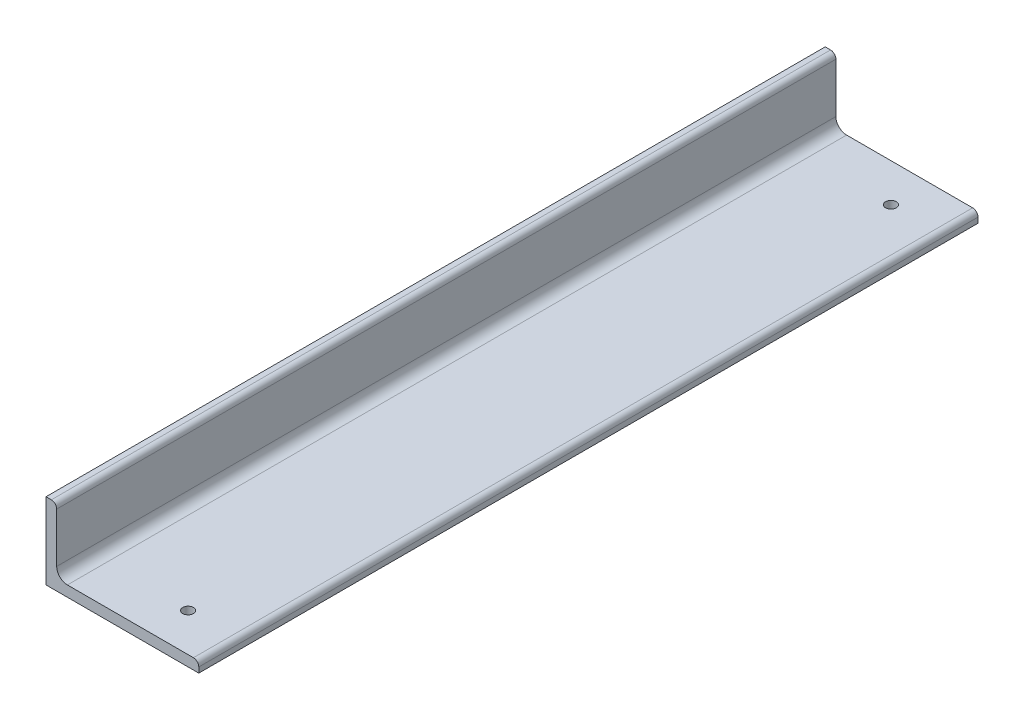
ISO-10303-21;
HEADER;
FILE_DESCRIPTION(('STEP AP214'),'2;1');
FILE_NAME('part.step','',(''),(''),'','','');
FILE_SCHEMA(('AUTOMOTIVE_DESIGN { 1 0 10303 214 1 1 1 1 }'));
ENDSEC;
DATA;
#1=APPLICATION_CONTEXT('core data for automotive mechanical design processes');
#2=APPLICATION_PROTOCOL_DEFINITION('international standard','automotive_design',2000,#1);
#3=PRODUCT_CONTEXT('',#1,'mechanical');
#4=PRODUCT('Part','Part','',(#3));
#5=PRODUCT_RELATED_PRODUCT_CATEGORY('part','',(#4));
#6=PRODUCT_DEFINITION_FORMATION('','',#4);
#7=PRODUCT_DEFINITION_CONTEXT('part definition',#1,'design');
#8=PRODUCT_DEFINITION('design','',#6,#7);
#9=PRODUCT_DEFINITION_SHAPE('','',#8);
#10=(LENGTH_UNIT() NAMED_UNIT(*) SI_UNIT(.MILLI.,.METRE.));
#11=(NAMED_UNIT(*) PLANE_ANGLE_UNIT() SI_UNIT($,.RADIAN.));
#12=(NAMED_UNIT(*) SI_UNIT($,.STERADIAN.) SOLID_ANGLE_UNIT());
#13=UNCERTAINTY_MEASURE_WITH_UNIT(LENGTH_MEASURE(1.E-05),#10,'distance_accuracy_value','');
#14=(GEOMETRIC_REPRESENTATION_CONTEXT(3) GLOBAL_UNCERTAINTY_ASSIGNED_CONTEXT((#13)) GLOBAL_UNIT_ASSIGNED_CONTEXT((#10,
#11,#12)) REPRESENTATION_CONTEXT('',''));
#15=CARTESIAN_POINT('',(0.,0.,0.));
#16=DIRECTION('',(0.,0.,1.));
#17=DIRECTION('',(1.,0.,0.));
#18=AXIS2_PLACEMENT_3D('',#15,#16,#17);
#19=CARTESIAN_POINT('',(0.,0.,1020.));
#20=DIRECTION('',(0.,1.,0.));
#21=DIRECTION('',(0.,0.,1.));
#22=AXIS2_PLACEMENT_3D('',#19,#20,#21);
#23=PLANE('',#22);
#24=CARTESIAN_POINT('',(136.,0.,970.));
#25=DIRECTION('',(0.,-1.,0.));
#26=DIRECTION('',(0.,0.,-1.));
#27=AXIS2_PLACEMENT_3D('',#24,#25,#26);
#28=CIRCLE('',#27,7.00000000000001);
#29=CARTESIAN_POINT('',(136.,0.,963.));
#30=VERTEX_POINT('',#29);
#31=EDGE_CURVE('E217',#30,#30,#28,.T.);
#32=ORIENTED_EDGE('',*,*,#31,.F.);
#33=EDGE_LOOP('',(#32));
#34=FACE_BOUND('',#33,.T.);
#35=CARTESIAN_POINT('',(136.,0.,50.));
#36=DIRECTION('',(0.,-1.,0.));
#37=DIRECTION('',(0.,0.,-1.));
#38=AXIS2_PLACEMENT_3D('',#35,#36,#37);
#39=CIRCLE('',#38,7.00000000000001);
#40=CARTESIAN_POINT('',(136.,0.,43.));
#41=VERTEX_POINT('',#40);
#42=EDGE_CURVE('E122',#41,#41,#39,.T.);
#43=ORIENTED_EDGE('',*,*,#42,.F.);
#44=EDGE_LOOP('',(#43));
#45=FACE_BOUND('',#44,.T.);
#46=DIRECTION('',(1.,0.,0.));
#47=VECTOR('',#46,1.);
#48=CARTESIAN_POINT('',(0.,0.,0.));
#49=LINE('',#48,#47);
#50=CARTESIAN_POINT('',(0.,0.,0.));
#51=VERTEX_POINT('',#50);
#52=CARTESIAN_POINT('',(200.,0.,0.));
#53=VERTEX_POINT('',#52);
#54=EDGE_CURVE('E105',#51,#53,#49,.T.);
#55=ORIENTED_EDGE('',*,*,#54,.T.);
#56=DIRECTION('',(0.,0.,-1.));
#57=VECTOR('',#56,1.);
#58=CARTESIAN_POINT('',(200.,0.,1020.));
#59=LINE('',#58,#57);
#60=CARTESIAN_POINT('',(200.,0.,1020.));
#61=VERTEX_POINT('',#60);
#62=EDGE_CURVE('E11',#61,#53,#59,.T.);
#63=ORIENTED_EDGE('',*,*,#62,.F.);
#64=DIRECTION('',(1.,0.,0.));
#65=VECTOR('',#64,1.);
#66=CARTESIAN_POINT('',(0.,0.,1020.));
#67=LINE('',#66,#65);
#68=CARTESIAN_POINT('',(0.,0.,1020.));
#69=VERTEX_POINT('',#68);
#70=EDGE_CURVE('E139',#69,#61,#67,.T.);
#71=ORIENTED_EDGE('',*,*,#70,.F.);
#72=DIRECTION('',(0.,0.,-1.));
#73=VECTOR('',#72,1.);
#74=CARTESIAN_POINT('',(0.,0.,1020.));
#75=LINE('',#74,#73);
#76=EDGE_CURVE('E118',#69,#51,#75,.T.);
#77=ORIENTED_EDGE('',*,*,#76,.T.);
#78=EDGE_LOOP('',(#55,#63,#71,#77));
#79=FACE_BOUND('',#78,.T.);
#80=ADVANCED_FACE('F31',(#34,#45,#79),#23,.F.);
#81=CARTESIAN_POINT('',(200.,6.99999999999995,1020.));
#82=DIRECTION('',(-1.,0.,0.));
#83=DIRECTION('',(0.,0.,1.));
#84=AXIS2_PLACEMENT_3D('',#81,#82,#83);
#85=PLANE('',#84);
#86=DIRECTION('',(0.,1.,0.));
#87=VECTOR('',#86,1.);
#88=CARTESIAN_POINT('',(200.,6.99999999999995,0.));
#89=LINE('',#88,#87);
#90=CARTESIAN_POINT('',(200.,6.99999999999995,0.));
#91=VERTEX_POINT('',#90);
#92=EDGE_CURVE('E101',#53,#91,#89,.T.);
#93=ORIENTED_EDGE('',*,*,#92,.T.);
#94=DIRECTION('',(0.,0.,-1.));
#95=VECTOR('',#94,1.);
#96=CARTESIAN_POINT('',(200.,6.99999999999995,1020.));
#97=LINE('',#96,#95);
#98=CARTESIAN_POINT('',(200.,6.99999999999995,1020.));
#99=VERTEX_POINT('',#98);
#100=EDGE_CURVE('E38',#99,#91,#97,.T.);
#101=ORIENTED_EDGE('',*,*,#100,.F.);
#102=DIRECTION('',(0.,1.,0.));
#103=VECTOR('',#102,1.);
#104=CARTESIAN_POINT('',(200.,6.99999999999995,1020.));
#105=LINE('',#104,#103);
#106=EDGE_CURVE('E114',#61,#99,#105,.T.);
#107=ORIENTED_EDGE('',*,*,#106,.F.);
#108=ORIENTED_EDGE('',*,*,#62,.T.);
#109=EDGE_LOOP('',(#93,#101,#107,#108));
#110=FACE_BOUND('',#109,.T.);
#111=ADVANCED_FACE('F113',(#110),#85,.F.);
#112=CARTESIAN_POINT('',(193.,7.,1020.));
#113=DIRECTION('',(0.,0.,-1.));
#114=DIRECTION('',(-1.,0.,0.));
#115=AXIS2_PLACEMENT_3D('',#112,#113,#114);
#116=CYLINDRICAL_SURFACE('',#115,7.);
#117=CARTESIAN_POINT('',(193.,7.,0.));
#118=DIRECTION('',(0.,0.,1.));
#119=DIRECTION('',(1.,0.,0.));
#120=AXIS2_PLACEMENT_3D('',#117,#118,#119);
#121=CIRCLE('',#120,7.);
#122=CARTESIAN_POINT('',(193.,14.,0.));
#123=VERTEX_POINT('',#122);
#124=EDGE_CURVE('E107',#91,#123,#121,.T.);
#125=ORIENTED_EDGE('',*,*,#124,.T.);
#126=DIRECTION('',(0.,0.,-1.));
#127=VECTOR('',#126,1.);
#128=CARTESIAN_POINT('',(193.,14.,1020.));
#129=LINE('',#128,#127);
#130=CARTESIAN_POINT('',(193.,14.,1020.));
#131=VERTEX_POINT('',#130);
#132=EDGE_CURVE('E170',#131,#123,#129,.T.);
#133=ORIENTED_EDGE('',*,*,#132,.F.);
#134=CARTESIAN_POINT('',(193.,7.,1020.));
#135=DIRECTION('',(0.,0.,1.));
#136=DIRECTION('',(1.,0.,0.));
#137=AXIS2_PLACEMENT_3D('',#134,#135,#136);
#138=CIRCLE('',#137,7.);
#139=EDGE_CURVE('E142',#99,#131,#138,.T.);
#140=ORIENTED_EDGE('',*,*,#139,.F.);
#141=ORIENTED_EDGE('',*,*,#100,.T.);
#142=EDGE_LOOP('',(#125,#133,#140,#141));
#143=FACE_BOUND('',#142,.T.);
#144=ADVANCED_FACE('F174',(#143),#116,.T.);
#145=CARTESIAN_POINT('',(28.,14.,1020.));
#146=DIRECTION('',(0.,-1.,0.));
#147=DIRECTION('',(1.,0.,0.));
#148=AXIS2_PLACEMENT_3D('',#145,#146,#147);
#149=PLANE('',#148);
#150=CARTESIAN_POINT('',(136.,14.,970.));
#151=DIRECTION('',(0.,-1.,0.));
#152=DIRECTION('',(1.,0.,0.));
#153=AXIS2_PLACEMENT_3D('',#150,#151,#152);
#154=CIRCLE('',#153,7.00000000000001);
#155=CARTESIAN_POINT('',(143.,14.,970.));
#156=VERTEX_POINT('',#155);
#157=EDGE_CURVE('E221',#156,#156,#154,.T.);
#158=ORIENTED_EDGE('',*,*,#157,.T.);
#159=EDGE_LOOP('',(#158));
#160=FACE_BOUND('',#159,.T.);
#161=CARTESIAN_POINT('',(136.,14.,50.));
#162=DIRECTION('',(0.,-1.,0.));
#163=DIRECTION('',(1.,0.,0.));
#164=AXIS2_PLACEMENT_3D('',#161,#162,#163);
#165=CIRCLE('',#164,7.00000000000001);
#166=CARTESIAN_POINT('',(143.,14.,50.));
#167=VERTEX_POINT('',#166);
#168=EDGE_CURVE('E119',#167,#167,#165,.T.);
#169=ORIENTED_EDGE('',*,*,#168,.T.);
#170=EDGE_LOOP('',(#169));
#171=FACE_BOUND('',#170,.T.);
#172=DIRECTION('',(-1.,0.,0.));
#173=VECTOR('',#172,1.);
#174=CARTESIAN_POINT('',(28.,14.,0.));
#175=LINE('',#174,#173);
#176=CARTESIAN_POINT('',(28.,14.,0.));
#177=VERTEX_POINT('',#176);
#178=EDGE_CURVE('E127',#123,#177,#175,.T.);
#179=ORIENTED_EDGE('',*,*,#178,.T.);
#180=DIRECTION('',(0.,0.,-1.));
#181=VECTOR('',#180,1.);
#182=CARTESIAN_POINT('',(28.,14.,1020.));
#183=LINE('',#182,#181);
#184=CARTESIAN_POINT('',(28.,14.,1020.));
#185=VERTEX_POINT('',#184);
#186=EDGE_CURVE('E167',#185,#177,#183,.T.);
#187=ORIENTED_EDGE('',*,*,#186,.F.);
#188=DIRECTION('',(-1.,0.,0.));
#189=VECTOR('',#188,1.);
#190=CARTESIAN_POINT('',(28.,14.,1020.));
#191=LINE('',#190,#189);
#192=EDGE_CURVE('E144',#131,#185,#191,.T.);
#193=ORIENTED_EDGE('',*,*,#192,.F.);
#194=ORIENTED_EDGE('',*,*,#132,.T.);
#195=EDGE_LOOP('',(#179,#187,#193,#194));
#196=FACE_BOUND('',#195,.T.);
#197=ADVANCED_FACE('F182',(#160,#171,#196),#149,.F.);
#198=CARTESIAN_POINT('',(28.,28.,1020.));
#199=DIRECTION('',(0.,0.,-1.));
#200=DIRECTION('',(-1.,0.,0.));
#201=AXIS2_PLACEMENT_3D('',#198,#199,#200);
#202=CYLINDRICAL_SURFACE('',#201,14.);
#203=CARTESIAN_POINT('',(28.,28.,0.));
#204=DIRECTION('',(0.,0.,-1.));
#205=DIRECTION('',(-1.,0.,0.));
#206=AXIS2_PLACEMENT_3D('',#203,#204,#205);
#207=CIRCLE('',#206,14.);
#208=CARTESIAN_POINT('',(14.,28.,0.));
#209=VERTEX_POINT('',#208);
#210=EDGE_CURVE('E129',#177,#209,#207,.T.);
#211=ORIENTED_EDGE('',*,*,#210,.T.);
#212=DIRECTION('',(0.,0.,-1.));
#213=VECTOR('',#212,1.);
#214=CARTESIAN_POINT('',(14.,28.,1020.));
#215=LINE('',#214,#213);
#216=CARTESIAN_POINT('',(14.,28.,1020.));
#217=VERTEX_POINT('',#216);
#218=EDGE_CURVE('E164',#217,#209,#215,.T.);
#219=ORIENTED_EDGE('',*,*,#218,.F.);
#220=CARTESIAN_POINT('',(28.,28.,1020.));
#221=DIRECTION('',(0.,0.,-1.));
#222=DIRECTION('',(-1.,0.,0.));
#223=AXIS2_PLACEMENT_3D('',#220,#221,#222);
#224=CIRCLE('',#223,14.);
#225=EDGE_CURVE('E146',#185,#217,#224,.T.);
#226=ORIENTED_EDGE('',*,*,#225,.F.);
#227=ORIENTED_EDGE('',*,*,#186,.T.);
#228=EDGE_LOOP('',(#211,#219,#226,#227));
#229=FACE_BOUND('',#228,.T.);
#230=ADVANCED_FACE('F185',(#229),#202,.F.);
#231=CARTESIAN_POINT('',(14.,93.,1020.));
#232=DIRECTION('',(-1.,0.,0.));
#233=DIRECTION('',(0.,-1.,0.));
#234=AXIS2_PLACEMENT_3D('',#231,#232,#233);
#235=PLANE('',#234);
#236=DIRECTION('',(0.,1.,0.));
#237=VECTOR('',#236,1.);
#238=CARTESIAN_POINT('',(14.,93.,0.));
#239=LINE('',#238,#237);
#240=CARTESIAN_POINT('',(14.,93.,0.));
#241=VERTEX_POINT('',#240);
#242=EDGE_CURVE('E131',#209,#241,#239,.T.);
#243=ORIENTED_EDGE('',*,*,#242,.T.);
#244=DIRECTION('',(0.,0.,-1.));
#245=VECTOR('',#244,1.);
#246=CARTESIAN_POINT('',(14.,93.,1020.));
#247=LINE('',#246,#245);
#248=CARTESIAN_POINT('',(14.,93.,1020.));
#249=VERTEX_POINT('',#248);
#250=EDGE_CURVE('E161',#249,#241,#247,.T.);
#251=ORIENTED_EDGE('',*,*,#250,.F.);
#252=DIRECTION('',(0.,1.,0.));
#253=VECTOR('',#252,1.);
#254=CARTESIAN_POINT('',(14.,93.,1020.));
#255=LINE('',#254,#253);
#256=EDGE_CURVE('E148',#217,#249,#255,.T.);
#257=ORIENTED_EDGE('',*,*,#256,.F.);
#258=ORIENTED_EDGE('',*,*,#218,.T.);
#259=EDGE_LOOP('',(#243,#251,#257,#258));
#260=FACE_BOUND('',#259,.T.);
#261=ADVANCED_FACE('F190',(#260),#235,.F.);
#262=CARTESIAN_POINT('',(7.,93.,1020.));
#263=DIRECTION('',(0.,0.,-1.));
#264=DIRECTION('',(-1.,0.,0.));
#265=AXIS2_PLACEMENT_3D('',#262,#263,#264);
#266=CYLINDRICAL_SURFACE('',#265,7.00000000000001);
#267=CARTESIAN_POINT('',(7.,93.,0.));
#268=DIRECTION('',(0.,0.,1.));
#269=DIRECTION('',(1.,0.,0.));
#270=AXIS2_PLACEMENT_3D('',#267,#268,#269);
#271=CIRCLE('',#270,7.00000000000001);
#272=CARTESIAN_POINT('',(7.,100.,0.));
#273=VERTEX_POINT('',#272);
#274=EDGE_CURVE('E133',#241,#273,#271,.T.);
#275=ORIENTED_EDGE('',*,*,#274,.T.);
#276=DIRECTION('',(0.,0.,-1.));
#277=VECTOR('',#276,1.);
#278=CARTESIAN_POINT('',(7.,100.,1020.));
#279=LINE('',#278,#277);
#280=CARTESIAN_POINT('',(7.,100.,1020.));
#281=VERTEX_POINT('',#280);
#282=EDGE_CURVE('E158',#281,#273,#279,.T.);
#283=ORIENTED_EDGE('',*,*,#282,.F.);
#284=CARTESIAN_POINT('',(7.,93.,1020.));
#285=DIRECTION('',(0.,0.,1.));
#286=DIRECTION('',(1.,0.,0.));
#287=AXIS2_PLACEMENT_3D('',#284,#285,#286);
#288=CIRCLE('',#287,7.00000000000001);
#289=EDGE_CURVE('E150',#249,#281,#288,.T.);
#290=ORIENTED_EDGE('',*,*,#289,.F.);
#291=ORIENTED_EDGE('',*,*,#250,.T.);
#292=EDGE_LOOP('',(#275,#283,#290,#291));
#293=FACE_BOUND('',#292,.T.);
#294=ADVANCED_FACE('F194',(#293),#266,.T.);
#295=CARTESIAN_POINT('',(0.,100.,1020.));
#296=DIRECTION('',(0.,-1.,0.));
#297=DIRECTION('',(1.,0.,0.));
#298=AXIS2_PLACEMENT_3D('',#295,#296,#297);
#299=PLANE('',#298);
#300=DIRECTION('',(-1.,0.,0.));
#301=VECTOR('',#300,1.);
#302=CARTESIAN_POINT('',(0.,100.,0.));
#303=LINE('',#302,#301);
#304=CARTESIAN_POINT('',(0.,100.,0.));
#305=VERTEX_POINT('',#304);
#306=EDGE_CURVE('E135',#273,#305,#303,.T.);
#307=ORIENTED_EDGE('',*,*,#306,.T.);
#308=DIRECTION('',(0.,0.,-1.));
#309=VECTOR('',#308,1.);
#310=CARTESIAN_POINT('',(0.,100.,1020.));
#311=LINE('',#310,#309);
#312=CARTESIAN_POINT('',(0.,100.,1020.));
#313=VERTEX_POINT('',#312);
#314=EDGE_CURVE('E155',#313,#305,#311,.T.);
#315=ORIENTED_EDGE('',*,*,#314,.F.);
#316=DIRECTION('',(-1.,0.,0.));
#317=VECTOR('',#316,1.);
#318=CARTESIAN_POINT('',(0.,100.,1020.));
#319=LINE('',#318,#317);
#320=EDGE_CURVE('E50',#281,#313,#319,.T.);
#321=ORIENTED_EDGE('',*,*,#320,.F.);
#322=ORIENTED_EDGE('',*,*,#282,.T.);
#323=EDGE_LOOP('',(#307,#315,#321,#322));
#324=FACE_BOUND('',#323,.T.);
#325=ADVANCED_FACE('F198',(#324),#299,.F.);
#326=CARTESIAN_POINT('',(0.,0.,1020.));
#327=DIRECTION('',(1.,0.,0.));
#328=DIRECTION('',(0.,0.,-1.));
#329=AXIS2_PLACEMENT_3D('',#326,#327,#328);
#330=PLANE('',#329);
#331=DIRECTION('',(0.,-1.,0.));
#332=VECTOR('',#331,1.);
#333=CARTESIAN_POINT('',(0.,0.,0.));
#334=LINE('',#333,#332);
#335=EDGE_CURVE('E137',#305,#51,#334,.T.);
#336=ORIENTED_EDGE('',*,*,#335,.T.);
#337=ORIENTED_EDGE('',*,*,#76,.F.);
#338=DIRECTION('',(0.,-1.,0.));
#339=VECTOR('',#338,1.);
#340=CARTESIAN_POINT('',(0.,0.,1020.));
#341=LINE('',#340,#339);
#342=EDGE_CURVE('E45',#313,#69,#341,.T.);
#343=ORIENTED_EDGE('',*,*,#342,.F.);
#344=ORIENTED_EDGE('',*,*,#314,.T.);
#345=EDGE_LOOP('',(#336,#337,#343,#344));
#346=FACE_BOUND('',#345,.T.);
#347=ADVANCED_FACE('F200',(#346),#330,.F.);
#348=CARTESIAN_POINT('',(193.,7.,1020.));
#349=DIRECTION('',(0.,0.,1.));
#350=DIRECTION('',(1.,0.,0.));
#351=AXIS2_PLACEMENT_3D('',#348,#349,#350);
#352=PLANE('',#351);
#353=ORIENTED_EDGE('',*,*,#70,.T.);
#354=ORIENTED_EDGE('',*,*,#106,.T.);
#355=ORIENTED_EDGE('',*,*,#139,.T.);
#356=ORIENTED_EDGE('',*,*,#192,.T.);
#357=ORIENTED_EDGE('',*,*,#225,.T.);
#358=ORIENTED_EDGE('',*,*,#256,.T.);
#359=ORIENTED_EDGE('',*,*,#289,.T.);
#360=ORIENTED_EDGE('',*,*,#320,.T.);
#361=ORIENTED_EDGE('',*,*,#342,.T.);
#362=EDGE_LOOP('',(#353,#354,#355,#356,#357,#358,#359,#360,#361));
#363=FACE_BOUND('',#362,.T.);
#364=ADVANCED_FACE('F177',(#363),#352,.T.);
#365=CARTESIAN_POINT('',(193.,7.,0.));
#366=DIRECTION('',(0.,0.,1.));
#367=DIRECTION('',(1.,0.,0.));
#368=AXIS2_PLACEMENT_3D('',#365,#366,#367);
#369=PLANE('',#368);
#370=ORIENTED_EDGE('',*,*,#54,.F.);
#371=ORIENTED_EDGE('',*,*,#335,.F.);
#372=ORIENTED_EDGE('',*,*,#306,.F.);
#373=ORIENTED_EDGE('',*,*,#274,.F.);
#374=ORIENTED_EDGE('',*,*,#242,.F.);
#375=ORIENTED_EDGE('',*,*,#210,.F.);
#376=ORIENTED_EDGE('',*,*,#178,.F.);
#377=ORIENTED_EDGE('',*,*,#124,.F.);
#378=ORIENTED_EDGE('',*,*,#92,.F.);
#379=EDGE_LOOP('',(#370,#371,#372,#373,#374,#375,#376,#377,#378));
#380=FACE_BOUND('',#379,.T.);
#381=ADVANCED_FACE('F102',(#380),#369,.F.);
#382=CARTESIAN_POINT('',(136.,0.,50.));
#383=DIRECTION('',(0.,-1.,0.));
#384=DIRECTION('',(0.,0.,-1.));
#385=AXIS2_PLACEMENT_3D('',#382,#383,#384);
#386=CYLINDRICAL_SURFACE('',#385,7.00000000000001);
#387=ORIENTED_EDGE('',*,*,#42,.T.);
#388=EDGE_LOOP('',(#387));
#389=FACE_BOUND('',#388,.T.);
#390=ORIENTED_EDGE('',*,*,#168,.F.);
#391=EDGE_LOOP('',(#390));
#392=FACE_BOUND('',#391,.T.);
#393=ADVANCED_FACE('F229',(#389,#392),#386,.F.);
#394=CARTESIAN_POINT('',(136.,0.,970.));
#395=DIRECTION('',(0.,-1.,0.));
#396=DIRECTION('',(0.,0.,-1.));
#397=AXIS2_PLACEMENT_3D('',#394,#395,#396);
#398=CYLINDRICAL_SURFACE('',#397,7.00000000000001);
#399=ORIENTED_EDGE('',*,*,#31,.T.);
#400=EDGE_LOOP('',(#399));
#401=FACE_BOUND('',#400,.T.);
#402=ORIENTED_EDGE('',*,*,#157,.F.);
#403=EDGE_LOOP('',(#402));
#404=FACE_BOUND('',#403,.T.);
#405=ADVANCED_FACE('F226',(#401,#404),#398,.F.);
#406=CLOSED_SHELL('',(#80,#111,#144,#197,#230,#261,#294,#325,#347,#364,#381,#393,#405));
#407=MANIFOLD_SOLID_BREP('B2',#406);
#408=ADVANCED_BREP_SHAPE_REPRESENTATION('',(#18,#407),#14);
#409=SHAPE_DEFINITION_REPRESENTATION(#9,#408);
ENDSEC;
END-ISO-10303-21;
